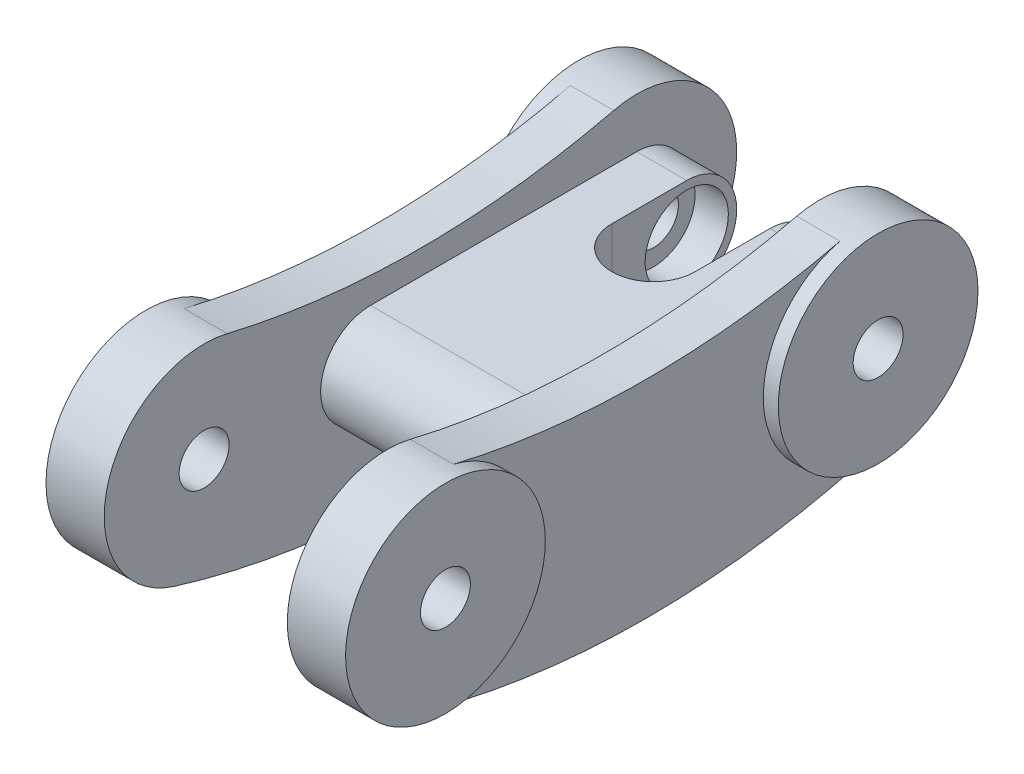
ISO-10303-21;
HEADER;
FILE_DESCRIPTION(('STEP AP214'),'2;1');
FILE_NAME('part.step','',(''),(''),'','','');
FILE_SCHEMA(('AUTOMOTIVE_DESIGN { 1 0 10303 214 1 1 1 1 }'));
ENDSEC;
DATA;
#1=APPLICATION_CONTEXT('core data for automotive mechanical design processes');
#2=APPLICATION_PROTOCOL_DEFINITION('international standard','automotive_design',2000,#1);
#3=PRODUCT_CONTEXT('',#1,'mechanical');
#4=PRODUCT('Part','Part','',(#3));
#5=PRODUCT_RELATED_PRODUCT_CATEGORY('part','',(#4));
#6=PRODUCT_DEFINITION_FORMATION('','',#4);
#7=PRODUCT_DEFINITION_CONTEXT('part definition',#1,'design');
#8=PRODUCT_DEFINITION('design','',#6,#7);
#9=PRODUCT_DEFINITION_SHAPE('','',#8);
#10=(LENGTH_UNIT() NAMED_UNIT(*) SI_UNIT(.MILLI.,.METRE.));
#11=(NAMED_UNIT(*) PLANE_ANGLE_UNIT() SI_UNIT($,.RADIAN.));
#12=(NAMED_UNIT(*) SI_UNIT($,.STERADIAN.) SOLID_ANGLE_UNIT());
#13=UNCERTAINTY_MEASURE_WITH_UNIT(LENGTH_MEASURE(1.E-05),#10,'distance_accuracy_value','');
#14=(GEOMETRIC_REPRESENTATION_CONTEXT(3) GLOBAL_UNCERTAINTY_ASSIGNED_CONTEXT((#13)) GLOBAL_UNIT_ASSIGNED_CONTEXT((#10,
#11,#12)) REPRESENTATION_CONTEXT('',''));
#15=CARTESIAN_POINT('',(0.,0.,0.));
#16=DIRECTION('',(0.,0.,1.));
#17=DIRECTION('',(1.,0.,0.));
#18=AXIS2_PLACEMENT_3D('',#15,#16,#17);
#19=CARTESIAN_POINT('',(0.,61.281230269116,-148.780880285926));
#20=DIRECTION('',(1.,0.,0.));
#21=DIRECTION('',(0.,0.,-1.));
#22=AXIS2_PLACEMENT_3D('',#19,#20,#21);
#23=PLANE('',#22);
#24=CARTESIAN_POINT('',(0.,0.,16.51));
#25=DIRECTION('',(-1.,0.,0.));
#26=DIRECTION('',(0.,0.,1.));
#27=AXIS2_PLACEMENT_3D('',#24,#25,#26);
#28=CIRCLE('',#27,7.62);
#29=CARTESIAN_POINT('',(0.,7.41183457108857,14.7410714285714));
#30=VERTEX_POINT('',#29);
#31=CARTESIAN_POINT('',(0.,-7.27981880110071,18.7613636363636));
#32=VERTEX_POINT('',#31);
#33=EDGE_CURVE('E158',#30,#32,#28,.T.);
#34=ORIENTED_EDGE('',*,*,#33,.F.);
#35=CARTESIAN_POINT('',(0.,69.1771226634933,0.));
#36=DIRECTION('',(1.,0.,0.));
#37=DIRECTION('',(0.,0.,-1.));
#38=AXIS2_PLACEMENT_3D('',#35,#36,#37);
#39=CIRCLE('',#38,63.5);
#40=CARTESIAN_POINT('',(0.,7.41183457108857,-14.7410714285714));
#41=VERTEX_POINT('',#40);
#42=EDGE_CURVE('E159',#30,#41,#39,.T.);
#43=ORIENTED_EDGE('',*,*,#42,.T.);
#44=CARTESIAN_POINT('',(0.,0.,-16.51));
#45=DIRECTION('',(-1.,0.,0.));
#46=DIRECTION('',(0.,0.,1.));
#47=AXIS2_PLACEMENT_3D('',#44,#45,#46);
#48=CIRCLE('',#47,7.62);
#49=CARTESIAN_POINT('',(0.,-7.27981880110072,-18.7613636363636));
#50=VERTEX_POINT('',#49);
#51=EDGE_CURVE('E11',#50,#41,#48,.T.);
#52=ORIENTED_EDGE('',*,*,#51,.F.);
#53=CARTESIAN_POINT('',(0.,53.3853378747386,0.));
#54=DIRECTION('',(1.,0.,0.));
#55=DIRECTION('',(0.,0.,-1.));
#56=AXIS2_PLACEMENT_3D('',#53,#54,#55);
#57=CIRCLE('',#56,63.5);
#58=EDGE_CURVE('E161',#32,#50,#57,.T.);
#59=ORIENTED_EDGE('',*,*,#58,.F.);
#60=EDGE_LOOP('',(#34,#43,#52,#59));
#61=FACE_BOUND('',#60,.T.);
#62=ADVANCED_FACE('F34',(#61),#23,.F.);
#63=CARTESIAN_POINT('',(20.574,26.6926689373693,8.25499999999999));
#64=DIRECTION('',(1.,0.,0.));
#65=DIRECTION('',(0.,0.,-1.));
#66=AXIS2_PLACEMENT_3D('',#63,#64,#65);
#67=PLANE('',#66);
#68=CARTESIAN_POINT('',(20.574,69.1771226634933,0.));
#69=DIRECTION('',(-1.,0.,0.));
#70=DIRECTION('',(0.,0.,-1.));
#71=AXIS2_PLACEMENT_3D('',#68,#69,#70);
#72=CIRCLE('',#71,63.5);
#73=CARTESIAN_POINT('',(20.574,7.41183457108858,-14.7410714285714));
#74=VERTEX_POINT('',#73);
#75=CARTESIAN_POINT('',(20.574,7.41183457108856,14.7410714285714));
#76=VERTEX_POINT('',#75);
#77=EDGE_CURVE('E200',#74,#76,#72,.T.);
#78=ORIENTED_EDGE('',*,*,#77,.T.);
#79=CARTESIAN_POINT('',(20.574,0.,16.51));
#80=DIRECTION('',(1.,0.,0.));
#81=DIRECTION('',(0.,0.,-1.));
#82=AXIS2_PLACEMENT_3D('',#79,#80,#81);
#83=CIRCLE('',#82,7.61999999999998);
#84=CARTESIAN_POINT('',(20.574,-7.2798188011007,18.7613636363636));
#85=VERTEX_POINT('',#84);
#86=EDGE_CURVE('E631',#85,#76,#83,.T.);
#87=ORIENTED_EDGE('',*,*,#86,.F.);
#88=CARTESIAN_POINT('',(20.574,53.3853378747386,0.));
#89=DIRECTION('',(1.,0.,0.));
#90=DIRECTION('',(0.,0.,-1.));
#91=AXIS2_PLACEMENT_3D('',#88,#89,#90);
#92=CIRCLE('',#91,63.5);
#93=CARTESIAN_POINT('',(20.574,-7.27981880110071,-18.7613636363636));
#94=VERTEX_POINT('',#93);
#95=EDGE_CURVE('E264',#85,#94,#92,.T.);
#96=ORIENTED_EDGE('',*,*,#95,.T.);
#97=CARTESIAN_POINT('',(20.574,0.,-16.51));
#98=DIRECTION('',(1.,0.,0.));
#99=DIRECTION('',(0.,0.,-1.));
#100=AXIS2_PLACEMENT_3D('',#97,#98,#99);
#101=CIRCLE('',#100,7.62);
#102=EDGE_CURVE('E203',#74,#94,#101,.T.);
#103=ORIENTED_EDGE('',*,*,#102,.F.);
#104=EDGE_LOOP('',(#78,#87,#96,#103));
#105=FACE_BOUND('',#104,.T.);
#106=ADVANCED_FACE('F345',(#105),#67,.T.);
#107=CARTESIAN_POINT('',(0.,0.,-16.51));
#108=DIRECTION('',(1.,0.,0.));
#109=DIRECTION('',(0.,0.,-1.));
#110=AXIS2_PLACEMENT_3D('',#107,#108,#109);
#111=CYLINDRICAL_SURFACE('',#110,1.905);
#112=CARTESIAN_POINT('',(16.002,0.,-16.51));
#113=DIRECTION('',(-1.,0.,0.));
#114=DIRECTION('',(0.,0.,1.));
#115=AXIS2_PLACEMENT_3D('',#112,#113,#114);
#116=CIRCLE('',#115,1.905);
#117=CARTESIAN_POINT('',(16.002,0.,-18.415));
#118=VERTEX_POINT('',#117);
#119=EDGE_CURVE('E220',#118,#118,#116,.F.);
#120=CARTESIAN_POINT('',(21.717,0.,-16.51));
#121=DIRECTION('',(1.,0.,0.));
#122=DIRECTION('',(0.,0.,-1.));
#123=AXIS2_PLACEMENT_3D('',#120,#121,#122);
#124=CIRCLE('',#123,1.905);
#125=CARTESIAN_POINT('',(21.717,0.,-18.415));
#126=VERTEX_POINT('',#125);
#127=EDGE_CURVE('E208',#126,#126,#124,.T.);
#128=CARTESIAN_POINT('',(16.002,0.,-18.415));
#129=CARTESIAN_POINT('',(16.06153125,0.,-18.415));
#130=CARTESIAN_POINT('',(16.1210625,0.,-18.415));
#131=CARTESIAN_POINT('',(16.240125,0.,-18.415));
#132=CARTESIAN_POINT('',(16.29965625,0.,-18.415));
#133=CARTESIAN_POINT('',(16.41871875,0.,-18.415));
#134=CARTESIAN_POINT('',(16.47825,0.,-18.415));
#135=CARTESIAN_POINT('',(16.5973125,0.,-18.415));
#136=CARTESIAN_POINT('',(16.65684375,0.,-18.415));
#137=CARTESIAN_POINT('',(16.77590625,0.,-18.415));
#138=CARTESIAN_POINT('',(16.8354375,0.,-18.415));
#139=CARTESIAN_POINT('',(16.9545,0.,-18.415));
#140=CARTESIAN_POINT('',(17.01403125,0.,-18.415));
#141=CARTESIAN_POINT('',(17.13309375,0.,-18.415));
#142=CARTESIAN_POINT('',(17.192625,0.,-18.415));
#143=CARTESIAN_POINT('',(17.3116875,0.,-18.415));
#144=CARTESIAN_POINT('',(17.37121875,0.,-18.415));
#145=CARTESIAN_POINT('',(17.49028125,0.,-18.415));
#146=CARTESIAN_POINT('',(17.5498125,0.,-18.415));
#147=CARTESIAN_POINT('',(17.668875,0.,-18.415));
#148=CARTESIAN_POINT('',(17.72840625,0.,-18.415));
#149=CARTESIAN_POINT('',(17.84746875,0.,-18.415));
#150=CARTESIAN_POINT('',(17.907,0.,-18.415));
#151=CARTESIAN_POINT('',(18.0260625,0.,-18.415));
#152=CARTESIAN_POINT('',(18.08559375,0.,-18.415));
#153=CARTESIAN_POINT('',(18.20465625,0.,-18.415));
#154=CARTESIAN_POINT('',(18.2641875,0.,-18.415));
#155=CARTESIAN_POINT('',(18.38325,0.,-18.415));
#156=CARTESIAN_POINT('',(18.44278125,0.,-18.415));
#157=CARTESIAN_POINT('',(18.56184375,0.,-18.415));
#158=CARTESIAN_POINT('',(18.621375,0.,-18.415));
#159=CARTESIAN_POINT('',(18.7404375,0.,-18.415));
#160=CARTESIAN_POINT('',(18.79996875,0.,-18.415));
#161=CARTESIAN_POINT('',(18.91903125,0.,-18.415));
#162=CARTESIAN_POINT('',(18.9785625,0.,-18.415));
#163=CARTESIAN_POINT('',(19.097625,0.,-18.415));
#164=CARTESIAN_POINT('',(19.15715625,0.,-18.415));
#165=CARTESIAN_POINT('',(19.27621875,0.,-18.415));
#166=CARTESIAN_POINT('',(19.33575,0.,-18.415));
#167=CARTESIAN_POINT('',(19.4548125,0.,-18.415));
#168=CARTESIAN_POINT('',(19.51434375,0.,-18.415));
#169=CARTESIAN_POINT('',(19.63340625,0.,-18.415));
#170=CARTESIAN_POINT('',(19.6929375,0.,-18.415));
#171=CARTESIAN_POINT('',(19.812,0.,-18.415));
#172=CARTESIAN_POINT('',(19.87153125,0.,-18.415));
#173=CARTESIAN_POINT('',(19.99059375,0.,-18.415));
#174=CARTESIAN_POINT('',(20.050125,0.,-18.415));
#175=CARTESIAN_POINT('',(20.1691875,0.,-18.415));
#176=CARTESIAN_POINT('',(20.22871875,0.,-18.415));
#177=CARTESIAN_POINT('',(20.34778125,0.,-18.415));
#178=CARTESIAN_POINT('',(20.4073125,0.,-18.415));
#179=CARTESIAN_POINT('',(20.526375,0.,-18.415));
#180=CARTESIAN_POINT('',(20.58590625,0.,-18.415));
#181=CARTESIAN_POINT('',(20.70496875,0.,-18.415));
#182=CARTESIAN_POINT('',(20.7645,0.,-18.415));
#183=CARTESIAN_POINT('',(20.8835625,0.,-18.415));
#184=CARTESIAN_POINT('',(20.94309375,0.,-18.415));
#185=CARTESIAN_POINT('',(21.06215625,0.,-18.415));
#186=CARTESIAN_POINT('',(21.1216875,0.,-18.415));
#187=CARTESIAN_POINT('',(21.24075,0.,-18.415));
#188=CARTESIAN_POINT('',(21.30028125,0.,-18.415));
#189=CARTESIAN_POINT('',(21.41934375,0.,-18.415));
#190=CARTESIAN_POINT('',(21.478875,0.,-18.415));
#191=CARTESIAN_POINT('',(21.5979375,0.,-18.415));
#192=CARTESIAN_POINT('',(21.65746875,0.,-18.415));
#193=CARTESIAN_POINT('',(21.717,0.,-18.415));
#194=B_SPLINE_CURVE_WITH_KNOTS('',3,(#128,#129,#130,#131,#132,#133,#134,#135,#136,#137,#138,
#139,#140,#141,#142,#143,#144,#145,#146,#147,#148,#149,#150,#151,#152,#153,#154,#155,#156,#157,
#158,#159,#160,#161,#162,#163,#164,#165,#166,#167,#168,#169,#170,#171,#172,#173,#174,#175,#176,
#177,#178,#179,#180,#181,#182,#183,#184,#185,#186,#187,#188,#189,#190,#191,#192,#193),
.UNSPECIFIED.,.F.,.F.,(4,2,2,2,2,2,2,2,2,2,2,2,2,2,2,2,2,2,2,2,2,2,2,2,2,2,2,2,2,2,2,2,4),(0.,
0.178593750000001,0.357187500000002,0.535781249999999,0.714375,0.892968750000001,1.0715625,
1.25015625,1.42875,1.60734375,1.7859375,1.96453125,2.143125,2.32171875,2.5003125,2.67890625,
2.8575,3.03609375,3.2146875,3.39328125,3.571875,3.75046875,3.9290625,4.10765625,4.28625,
4.46484375,4.6434375,4.82203125,5.000625,5.17921875,5.3578125,5.53640625,5.715),.UNSPECIFIED.);
#195=EDGE_CURVE('BSEAM350',#118,#126,#194,.T.);
#196=ORIENTED_EDGE('',*,*,#119,.F.);
#197=ORIENTED_EDGE('',*,*,#127,.T.);
#198=ORIENTED_EDGE('',*,*,#195,.T.);
#199=ORIENTED_EDGE('',*,*,#195,.F.);
#200=EDGE_LOOP('',(#196,#198,#197,#199));
#201=FACE_BOUND('',#200,.T.);
#202=ADVANCED_FACE('F350',(#201),#111,.F.);
#203=CARTESIAN_POINT('',(4.572,0.,-16.51));
#204=DIRECTION('',(1.,0.,0.));
#205=DIRECTION('',(0.,0.,-1.));
#206=AXIS2_PLACEMENT_3D('',#203,#204,#205);
#207=CIRCLE('',#206,1.905);
#208=CARTESIAN_POINT('',(4.572,0.,-18.415));
#209=VERTEX_POINT('',#208);
#210=EDGE_CURVE('E226',#209,#209,#207,.F.);
#211=CARTESIAN_POINT('',(-1.143,0.,-16.51));
#212=DIRECTION('',(-1.,0.,0.));
#213=DIRECTION('',(0.,0.,1.));
#214=AXIS2_PLACEMENT_3D('',#211,#212,#213);
#215=CIRCLE('',#214,1.905);
#216=CARTESIAN_POINT('',(-1.143,0.,-18.415));
#217=VERTEX_POINT('',#216);
#218=EDGE_CURVE('E210',#217,#217,#215,.T.);
#219=CARTESIAN_POINT('',(4.572,0.,-18.415));
#220=CARTESIAN_POINT('',(4.51246875,0.,-18.415));
#221=CARTESIAN_POINT('',(4.45293749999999,0.,-18.415));
#222=CARTESIAN_POINT('',(4.333875,0.,-18.415));
#223=CARTESIAN_POINT('',(4.27434375,0.,-18.415));
#224=CARTESIAN_POINT('',(4.15528125,0.,-18.415));
#225=CARTESIAN_POINT('',(4.09575,0.,-18.415));
#226=CARTESIAN_POINT('',(3.9766875,0.,-18.415));
#227=CARTESIAN_POINT('',(3.91715625,0.,-18.415));
#228=CARTESIAN_POINT('',(3.79809375,0.,-18.415));
#229=CARTESIAN_POINT('',(3.7385625,0.,-18.415));
#230=CARTESIAN_POINT('',(3.6195,0.,-18.415));
#231=CARTESIAN_POINT('',(3.55996875,0.,-18.415));
#232=CARTESIAN_POINT('',(3.44090625,0.,-18.415));
#233=CARTESIAN_POINT('',(3.381375,0.,-18.415));
#234=CARTESIAN_POINT('',(3.2623125,0.,-18.415));
#235=CARTESIAN_POINT('',(3.20278125,0.,-18.415));
#236=CARTESIAN_POINT('',(3.08371875,0.,-18.415));
#237=CARTESIAN_POINT('',(3.0241875,0.,-18.415));
#238=CARTESIAN_POINT('',(2.905125,0.,-18.415));
#239=CARTESIAN_POINT('',(2.84559375,0.,-18.415));
#240=CARTESIAN_POINT('',(2.72653125,0.,-18.415));
#241=CARTESIAN_POINT('',(2.667,0.,-18.415));
#242=CARTESIAN_POINT('',(2.5479375,0.,-18.415));
#243=CARTESIAN_POINT('',(2.48840625,0.,-18.415));
#244=CARTESIAN_POINT('',(2.36934375,0.,-18.415));
#245=CARTESIAN_POINT('',(2.3098125,0.,-18.415));
#246=CARTESIAN_POINT('',(2.19075,0.,-18.415));
#247=CARTESIAN_POINT('',(2.13121875,0.,-18.415));
#248=CARTESIAN_POINT('',(2.01215625,0.,-18.415));
#249=CARTESIAN_POINT('',(1.952625,0.,-18.415));
#250=CARTESIAN_POINT('',(1.8335625,0.,-18.415));
#251=CARTESIAN_POINT('',(1.77403125,0.,-18.415));
#252=CARTESIAN_POINT('',(1.65496875,0.,-18.415));
#253=CARTESIAN_POINT('',(1.5954375,0.,-18.415));
#254=CARTESIAN_POINT('',(1.476375,0.,-18.415));
#255=CARTESIAN_POINT('',(1.41684375,0.,-18.415));
#256=CARTESIAN_POINT('',(1.29778125,0.,-18.415));
#257=CARTESIAN_POINT('',(1.23825,0.,-18.415));
#258=CARTESIAN_POINT('',(1.1191875,0.,-18.415));
#259=CARTESIAN_POINT('',(1.05965625,0.,-18.415));
#260=CARTESIAN_POINT('',(0.940593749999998,0.,-18.415));
#261=CARTESIAN_POINT('',(0.881062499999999,0.,-18.415));
#262=CARTESIAN_POINT('',(0.761999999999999,0.,-18.415));
#263=CARTESIAN_POINT('',(0.702468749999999,0.,-18.415));
#264=CARTESIAN_POINT('',(0.583406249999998,0.,-18.415));
#265=CARTESIAN_POINT('',(0.523874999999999,0.,-18.415));
#266=CARTESIAN_POINT('',(0.404812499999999,0.,-18.415));
#267=CARTESIAN_POINT('',(0.345281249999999,0.,-18.415));
#268=CARTESIAN_POINT('',(0.22621875,0.,-18.415));
#269=CARTESIAN_POINT('',(0.1666875,0.,-18.415));
#270=CARTESIAN_POINT('',(0.0476249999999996,0.,-18.415));
#271=CARTESIAN_POINT('',(-0.0119062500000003,0.,-18.415));
#272=CARTESIAN_POINT('',(-0.13096875,0.,-18.415));
#273=CARTESIAN_POINT('',(-0.1905,0.,-18.415));
#274=CARTESIAN_POINT('',(-0.3095625,0.,-18.415));
#275=CARTESIAN_POINT('',(-0.36909375,0.,-18.415));
#276=CARTESIAN_POINT('',(-0.48815625,0.,-18.415));
#277=CARTESIAN_POINT('',(-0.5476875,0.,-18.415));
#278=CARTESIAN_POINT('',(-0.66675,0.,-18.415));
#279=CARTESIAN_POINT('',(-0.72628125,0.,-18.415));
#280=CARTESIAN_POINT('',(-0.84534375,0.,-18.415));
#281=CARTESIAN_POINT('',(-0.904875,0.,-18.415));
#282=CARTESIAN_POINT('',(-1.0239375,0.,-18.415));
#283=CARTESIAN_POINT('',(-1.08346875,0.,-18.415));
#284=CARTESIAN_POINT('',(-1.143,0.,-18.415));
#285=B_SPLINE_CURVE_WITH_KNOTS('',3,(#219,#220,#221,#222,#223,#224,#225,#226,#227,#228,#229,
#230,#231,#232,#233,#234,#235,#236,#237,#238,#239,#240,#241,#242,#243,#244,#245,#246,#247,#248,
#249,#250,#251,#252,#253,#254,#255,#256,#257,#258,#259,#260,#261,#262,#263,#264,#265,#266,#267,
#268,#269,#270,#271,#272,#273,#274,#275,#276,#277,#278,#279,#280,#281,#282,#283,#284),
.UNSPECIFIED.,.F.,.F.,(4,2,2,2,2,2,2,2,2,2,2,2,2,2,2,2,2,2,2,2,2,2,2,2,2,2,2,2,2,2,2,2,4),(0.,
0.17859375,0.3571875,0.53578125,0.714374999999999,0.892968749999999,1.0715625,1.25015625,
1.42875,1.60734375,1.7859375,1.96453125,2.143125,2.32171875,2.5003125,2.67890625,2.8575,
3.03609375,3.2146875,3.39328125,3.571875,3.75046875,3.9290625,4.10765625,4.28625,4.46484375,
4.6434375,4.82203125,5.000625,5.17921875,5.3578125,5.53640625,5.715),.UNSPECIFIED.);
#286=EDGE_CURVE('BSEAM414',#209,#217,#285,.T.);
#287=ORIENTED_EDGE('',*,*,#210,.F.);
#288=ORIENTED_EDGE('',*,*,#218,.T.);
#289=ORIENTED_EDGE('',*,*,#286,.T.);
#290=ORIENTED_EDGE('',*,*,#286,.F.);
#291=EDGE_LOOP('',(#287,#289,#288,#290));
#292=FACE_BOUND('',#291,.T.);
#293=ADVANCED_FACE('F414',(#292),#111,.F.);
#294=CARTESIAN_POINT('',(10.287,-8.89,-10.795));
#295=DIRECTION('',(0.,1.,0.));
#296=DIRECTION('',(0.,0.,1.));
#297=AXIS2_PLACEMENT_3D('',#294,#295,#296);
#298=CYLINDRICAL_SURFACE('',#297,3.175);
#299=CARTESIAN_POINT('',(10.287,-3.81,-10.795));
#300=DIRECTION('',(0.,-1.,0.));
#301=DIRECTION('',(0.,0.,-1.));
#302=AXIS2_PLACEMENT_3D('',#299,#300,#301);
#303=CIRCLE('',#302,3.175);
#304=CARTESIAN_POINT('',(13.462,-3.81,-10.795));
#305=VERTEX_POINT('',#304);
#306=CARTESIAN_POINT('',(7.112,-3.81,-10.795));
#307=VERTEX_POINT('',#306);
#308=EDGE_CURVE('E43',#305,#307,#303,.T.);
#309=ORIENTED_EDGE('',*,*,#308,.T.);
#310=DIRECTION('',(0.,1.,0.));
#311=VECTOR('',#310,1.);
#312=CARTESIAN_POINT('',(7.112,-8.89,-10.795));
#313=LINE('',#312,#311);
#314=CARTESIAN_POINT('',(7.112,3.81,-10.795));
#315=VERTEX_POINT('',#314);
#316=EDGE_CURVE('E243',#307,#315,#313,.T.);
#317=ORIENTED_EDGE('',*,*,#316,.T.);
#318=CARTESIAN_POINT('',(10.287,3.81,-10.795));
#319=DIRECTION('',(0.,1.,0.));
#320=DIRECTION('',(0.,0.,1.));
#321=AXIS2_PLACEMENT_3D('',#318,#319,#320);
#322=CIRCLE('',#321,3.175);
#323=CARTESIAN_POINT('',(13.462,3.81,-10.795));
#324=VERTEX_POINT('',#323);
#325=EDGE_CURVE('E237',#315,#324,#322,.T.);
#326=ORIENTED_EDGE('',*,*,#325,.T.);
#327=DIRECTION('',(0.,1.,0.));
#328=VECTOR('',#327,1.);
#329=CARTESIAN_POINT('',(13.462,-8.89,-10.795));
#330=LINE('',#329,#328);
#331=EDGE_CURVE('E244',#305,#324,#330,.T.);
#332=ORIENTED_EDGE('',*,*,#331,.F.);
#333=EDGE_LOOP('',(#309,#317,#326,#332));
#334=FACE_BOUND('',#333,.T.);
#335=CARTESIAN_POINT('',(9.2075,0.,-7.80914924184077));
#336=CARTESIAN_POINT('',(9.20750061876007,0.0517379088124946,-7.80914869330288));
#337=CARTESIAN_POINT('',(9.21173077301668,0.103481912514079,-7.8076093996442));
#338=CARTESIAN_POINT('',(9.22848457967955,0.205443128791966,-7.80163286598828));
#339=CARTESIAN_POINT('',(9.24101120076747,0.255659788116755,-7.79719458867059));
#340=CARTESIAN_POINT('',(9.27386166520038,0.353061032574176,-7.78593472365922));
#341=CARTESIAN_POINT('',(9.29416953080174,0.400251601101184,-7.77911802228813));
#342=CARTESIAN_POINT('',(9.34194063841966,0.490557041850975,-7.76380971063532));
#343=CARTESIAN_POINT('',(9.36940514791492,0.533671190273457,-7.75531780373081));
#344=CARTESIAN_POINT('',(9.43186413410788,0.616322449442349,-7.73714769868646));
#345=CARTESIAN_POINT('',(9.46709478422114,0.655674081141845,-7.72743772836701));
#346=CARTESIAN_POINT('',(9.54356517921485,0.728036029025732,-7.70801371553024));
#347=CARTESIAN_POINT('',(9.58480610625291,0.761045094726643,-7.69829967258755));
#348=CARTESIAN_POINT('',(9.67376611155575,0.820852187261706,-7.67944214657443));
#349=CARTESIAN_POINT('',(9.72165414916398,0.847409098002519,-7.67032810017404));
#350=CARTESIAN_POINT('',(9.82153130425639,0.892011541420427,-7.6538980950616));
#351=CARTESIAN_POINT('',(9.87351967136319,0.910058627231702,-7.64658180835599));
#352=CARTESIAN_POINT('',(9.97872918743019,0.936623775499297,-7.6345690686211));
#353=CARTESIAN_POINT('',(10.0318839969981,0.945375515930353,-7.62980993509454));
#354=CARTESIAN_POINT('',(10.1390748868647,0.953785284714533,-7.6229936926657));
#355=CARTESIAN_POINT('',(10.1931107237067,0.953445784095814,-7.62093584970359));
#356=CARTESIAN_POINT('',(10.2982250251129,0.94383479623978,-7.61960189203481));
#357=CARTESIAN_POINT('',(10.3493352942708,0.934921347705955,-7.62021773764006));
#358=CARTESIAN_POINT('',(10.4493567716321,0.908954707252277,-7.62375882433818));
#359=CARTESIAN_POINT('',(10.4982679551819,0.891901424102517,-7.6266840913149));
#360=CARTESIAN_POINT('',(10.5926038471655,0.850161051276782,-7.63438680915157));
#361=CARTESIAN_POINT('',(10.6380252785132,0.825466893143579,-7.63916597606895));
#362=CARTESIAN_POINT('',(10.7241900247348,0.76915289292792,-7.64994387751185));
#363=CARTESIAN_POINT('',(10.7649324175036,0.737531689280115,-7.65594285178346));
#364=CARTESIAN_POINT('',(10.8420357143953,0.667011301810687,-7.66863787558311));
#365=CARTESIAN_POINT('',(10.8782022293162,0.627902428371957,-7.67535062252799));
#366=CARTESIAN_POINT('',(10.9435507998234,0.54417386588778,-7.68844568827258));
#367=CARTESIAN_POINT('',(10.9727320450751,0.499553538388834,-7.69482796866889));
#368=CARTESIAN_POINT('',(11.0236789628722,0.405251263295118,-7.7065334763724));
#369=CARTESIAN_POINT('',(11.0453277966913,0.355503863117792,-7.71183952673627));
#370=CARTESIAN_POINT('',(11.0799030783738,0.252909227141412,-7.72054869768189));
#371=CARTESIAN_POINT('',(11.0928315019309,0.2000626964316,-7.7239522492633));
#372=CARTESIAN_POINT('',(11.1093001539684,0.0942286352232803,-7.72832119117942));
#373=CARTESIAN_POINT('',(11.1130742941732,0.0412800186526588,-7.72934729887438));
#374=CARTESIAN_POINT('',(11.1117842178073,-0.0644974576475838,-7.72899989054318));
#375=CARTESIAN_POINT('',(11.1067210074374,-0.117326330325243,-7.72762664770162));
#376=CARTESIAN_POINT('',(11.0881349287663,-0.220225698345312,-7.72272139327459));
#377=CARTESIAN_POINT('',(11.0747896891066,-0.270330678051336,-7.71923474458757));
#378=CARTESIAN_POINT('',(11.0402254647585,-0.367592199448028,-7.71058893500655));
#379=CARTESIAN_POINT('',(11.0190054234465,-0.414748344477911,-7.70542954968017));
#380=CARTESIAN_POINT('',(10.9687850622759,-0.505849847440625,-7.69395685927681));
#381=CARTESIAN_POINT('',(10.939633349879,-0.549708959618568,-7.68762195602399));
#382=CARTESIAN_POINT('',(10.8745386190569,-0.632016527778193,-7.6746598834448));
#383=CARTESIAN_POINT('',(10.838594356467,-0.67046399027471,-7.66803266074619));
#384=CARTESIAN_POINT('',(10.759775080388,-0.741909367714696,-7.65513654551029));
#385=CARTESIAN_POINT('',(10.7167406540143,-0.774734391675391,-7.64888194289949));
#386=CARTESIAN_POINT('',(10.6256065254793,-0.832695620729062,-7.6377742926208));
#387=CARTESIAN_POINT('',(10.5775073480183,-0.857832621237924,-7.63292109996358));
#388=CARTESIAN_POINT('',(10.4782584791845,-0.899345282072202,-7.62538069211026));
#389=CARTESIAN_POINT('',(10.4271580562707,-0.915833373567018,-7.62266543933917));
#390=CARTESIAN_POINT('',(10.3228496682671,-0.940000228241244,-7.61977429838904));
#391=CARTESIAN_POINT('',(10.2696422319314,-0.947681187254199,-7.61959777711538));
#392=CARTESIAN_POINT('',(10.1645689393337,-0.953892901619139,-7.62194081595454));
#393=CARTESIAN_POINT('',(10.1127185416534,-0.952724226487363,-7.62436942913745));
#394=CARTESIAN_POINT('',(10.0100665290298,-0.942039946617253,-7.63168195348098));
#395=CARTESIAN_POINT('',(9.95926491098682,-0.932524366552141,-7.63656585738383));
#396=CARTESIAN_POINT('',(9.8601253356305,-0.905522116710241,-7.64843104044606));
#397=CARTESIAN_POINT('',(9.81178601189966,-0.88803992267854,-7.65541114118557));
#398=CARTESIAN_POINT('',(9.71873769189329,-0.845670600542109,-7.67091124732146));
#399=CARTESIAN_POINT('',(9.67402944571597,-0.820781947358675,-7.67943156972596));
#400=CARTESIAN_POINT('',(9.58760010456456,-0.763162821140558,-7.69766356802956));
#401=CARTESIAN_POINT('',(9.54606663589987,-0.730161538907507,-7.70740899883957));
#402=CARTESIAN_POINT('',(9.46902812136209,-0.65773157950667,-7.72691764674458));
#403=CARTESIAN_POINT('',(9.43352499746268,-0.61830086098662,-7.73668086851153));
#404=CARTESIAN_POINT('',(9.36853375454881,-0.532734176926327,-7.7555551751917));
#405=CARTESIAN_POINT('',(9.3392484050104,-0.486437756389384,-7.76463936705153));
#406=CARTESIAN_POINT('',(9.28894701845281,-0.389246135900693,-7.78083049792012));
#407=CARTESIAN_POINT('',(9.26792603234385,-0.338353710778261,-7.78793861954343));
#408=CARTESIAN_POINT('',(9.23693892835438,-0.239880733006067,-7.79863029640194));
#409=CARTESIAN_POINT('',(9.22593194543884,-0.192661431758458,-7.80253957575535));
#410=CARTESIAN_POINT('',(9.21121312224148,-0.096962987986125,-7.80779897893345));
#411=CARTESIAN_POINT('',(9.20749942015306,-0.0484841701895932,-7.80914975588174));
#412=CARTESIAN_POINT('',(9.2075,0.,-7.80914924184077));
#413=B_SPLINE_CURVE_WITH_KNOTS('',3,(#335,#336,#337,#338,#339,#340,#341,#342,#343,#344,#345,
#346,#347,#348,#349,#350,#351,#352,#353,#354,#355,#356,#357,#358,#359,#360,#361,#362,#363,#364,
#365,#366,#367,#368,#369,#370,#371,#372,#373,#374,#375,#376,#377,#378,#379,#380,#381,#382,#383,
#384,#385,#386,#387,#388,#389,#390,#391,#392,#393,#394,#395,#396,#397,#398,#399,#400,#401,#402,
#403,#404,#405,#406,#407,#408,#409,#410,#411,#412),.UNSPECIFIED.,.T.,.F.,(4,2,2,2,2,2,2,2,2,2,2,
2,2,2,2,2,2,2,2,2,2,2,2,2,2,2,2,2,2,2,2,2,2,2,2,2,2,2,4),(0.,0.155033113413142,
0.310121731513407,0.464893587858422,0.61969287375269,0.780084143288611,0.940507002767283,
1.1062277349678,1.27191820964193,1.43333691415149,1.59471174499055,1.74962769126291,
1.90454537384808,2.05960679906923,2.21469873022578,2.37502731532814,2.53537449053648,
2.69810828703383,2.8608052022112,3.01929890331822,3.17777455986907,3.33296347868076,
3.48817322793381,3.6465830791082,3.80502197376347,3.9676907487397,4.13034268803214,
4.29082428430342,4.45126585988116,4.6062832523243,4.76130018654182,4.9162301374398,
5.07119201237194,5.23227197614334,5.39340318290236,5.55917676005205,5.72485091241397,
5.8701712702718,6.01545452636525),.UNSPECIFIED.);
#414=CARTESIAN_POINT('',(9.2075,0.,-7.80914924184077));
#415=VERTEX_POINT('',#414);
#416=EDGE_CURVE('E233',#415,#415,#413,.T.);
#417=ORIENTED_EDGE('',*,*,#416,.F.);
#418=EDGE_LOOP('',(#417));
#419=FACE_BOUND('',#418,.T.);
#420=ADVANCED_FACE('F322',(#334,#419),#298,.F.);
#421=CARTESIAN_POINT('',(17.272,0.,-16.51));
#422=DIRECTION('',(-1.,0.,0.));
#423=DIRECTION('',(0.,0.,1.));
#424=AXIS2_PLACEMENT_3D('',#421,#422,#423);
#425=CYLINDRICAL_SURFACE('',#424,3.81);
#426=CARTESIAN_POINT('',(13.462,0.,-16.51));
#427=DIRECTION('',(-1.,0.,0.));
#428=DIRECTION('',(0.,0.,1.));
#429=AXIS2_PLACEMENT_3D('',#426,#427,#428);
#430=CIRCLE('',#429,3.81);
#431=CARTESIAN_POINT('',(13.462,3.81,-16.51));
#432=VERTEX_POINT('',#431);
#433=CARTESIAN_POINT('',(13.462,-3.81,-16.51));
#434=VERTEX_POINT('',#433);
#435=EDGE_CURVE('E171',#432,#434,#430,.T.);
#436=ORIENTED_EDGE('',*,*,#435,.F.);
#437=DIRECTION('',(-1.,0.,0.));
#438=VECTOR('',#437,1.);
#439=CARTESIAN_POINT('',(17.272,3.81,-16.51));
#440=LINE('',#439,#438);
#441=CARTESIAN_POINT('',(17.272,3.81,-16.51));
#442=VERTEX_POINT('',#441);
#443=EDGE_CURVE('E297',#442,#432,#440,.T.);
#444=ORIENTED_EDGE('',*,*,#443,.F.);
#445=CARTESIAN_POINT('',(17.272,0.,-16.51));
#446=DIRECTION('',(1.,0.,0.));
#447=DIRECTION('',(0.,0.,-1.));
#448=AXIS2_PLACEMENT_3D('',#445,#446,#447);
#449=CIRCLE('',#448,3.81);
#450=CARTESIAN_POINT('',(17.272,-3.81,-16.51));
#451=VERTEX_POINT('',#450);
#452=EDGE_CURVE('E284',#451,#442,#449,.T.);
#453=ORIENTED_EDGE('',*,*,#452,.F.);
#454=DIRECTION('',(-1.,0.,0.));
#455=VECTOR('',#454,1.);
#456=CARTESIAN_POINT('',(17.272,-3.81,-16.51));
#457=LINE('',#456,#455);
#458=EDGE_CURVE('E300',#451,#434,#457,.T.);
#459=ORIENTED_EDGE('',*,*,#458,.T.);
#460=EDGE_LOOP('',(#436,#444,#453,#459));
#461=FACE_BOUND('',#460,.T.);
#462=ADVANCED_FACE('F372',(#461),#425,.T.);
#463=CARTESIAN_POINT('',(3.302,61.281230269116,-148.780880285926));
#464=DIRECTION('',(1.,0.,0.));
#465=DIRECTION('',(0.,0.,-1.));
#466=AXIS2_PLACEMENT_3D('',#463,#464,#465);
#467=PLANE('',#466);
#468=CARTESIAN_POINT('',(3.302,69.1771226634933,0.));
#469=DIRECTION('',(1.,0.,0.));
#470=DIRECTION('',(0.,0.,-1.));
#471=AXIS2_PLACEMENT_3D('',#468,#469,#470);
#472=CIRCLE('',#471,63.5);
#473=CARTESIAN_POINT('',(3.302,7.41183457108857,14.7410714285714));
#474=VERTEX_POINT('',#473);
#475=CARTESIAN_POINT('',(3.302,7.41183457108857,-14.7410714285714));
#476=VERTEX_POINT('',#475);
#477=EDGE_CURVE('E177',#474,#476,#472,.T.);
#478=ORIENTED_EDGE('',*,*,#477,.F.);
#479=CARTESIAN_POINT('',(3.302,0.,16.51));
#480=DIRECTION('',(1.,0.,0.));
#481=DIRECTION('',(0.,0.,-1.));
#482=AXIS2_PLACEMENT_3D('',#479,#480,#481);
#483=CIRCLE('',#482,7.62);
#484=CARTESIAN_POINT('',(3.302,-7.27981880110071,18.7613636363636));
#485=VERTEX_POINT('',#484);
#486=EDGE_CURVE('E170',#474,#485,#483,.T.);
#487=ORIENTED_EDGE('',*,*,#486,.T.);
#488=CARTESIAN_POINT('',(3.302,53.3853378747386,0.));
#489=DIRECTION('',(1.,0.,0.));
#490=DIRECTION('',(0.,0.,-1.));
#491=AXIS2_PLACEMENT_3D('',#488,#489,#490);
#492=CIRCLE('',#491,63.5);
#493=CARTESIAN_POINT('',(3.302,-7.27981880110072,-18.7613636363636));
#494=VERTEX_POINT('',#493);
#495=EDGE_CURVE('E308',#485,#494,#492,.T.);
#496=ORIENTED_EDGE('',*,*,#495,.T.);
#497=CARTESIAN_POINT('',(3.302,0.,-16.51));
#498=DIRECTION('',(1.,0.,0.));
#499=DIRECTION('',(0.,0.,-1.));
#500=AXIS2_PLACEMENT_3D('',#497,#498,#499);
#501=CIRCLE('',#500,7.62);
#502=EDGE_CURVE('E60',#494,#476,#501,.T.);
#503=ORIENTED_EDGE('',*,*,#502,.T.);
#504=EDGE_LOOP('',(#478,#487,#496,#503));
#505=FACE_BOUND('',#504,.T.);
#506=CARTESIAN_POINT('',(3.302,0.,16.51));
#507=DIRECTION('',(1.,0.,0.));
#508=DIRECTION('',(0.,0.,-1.));
#509=AXIS2_PLACEMENT_3D('',#506,#507,#508);
#510=CIRCLE('',#509,1.905);
#511=CARTESIAN_POINT('',(3.302,0.,14.605));
#512=VERTEX_POINT('',#511);
#513=EDGE_CURVE('E175',#512,#512,#510,.T.);
#514=ORIENTED_EDGE('',*,*,#513,.F.);
#515=EDGE_LOOP('',(#514));
#516=FACE_BOUND('',#515,.T.);
#517=CARTESIAN_POINT('',(3.302,0.,3.81));
#518=DIRECTION('',(1.,0.,0.));
#519=DIRECTION('',(0.,0.,-1.));
#520=AXIS2_PLACEMENT_3D('',#517,#518,#519);
#521=CIRCLE('',#520,3.81);
#522=CARTESIAN_POINT('',(3.302,3.81,3.81));
#523=VERTEX_POINT('',#522);
#524=CARTESIAN_POINT('',(3.302,-3.81,3.81));
#525=VERTEX_POINT('',#524);
#526=EDGE_CURVE('E290',#523,#525,#521,.T.);
#527=ORIENTED_EDGE('',*,*,#526,.F.);
#528=DIRECTION('',(0.,0.,1.));
#529=VECTOR('',#528,1.);
#530=CARTESIAN_POINT('',(3.302,3.81000000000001,-40.1332359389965));
#531=LINE('',#530,#529);
#532=CARTESIAN_POINT('',(3.302,3.81,-16.51));
#533=VERTEX_POINT('',#532);
#534=EDGE_CURVE('E272',#533,#523,#531,.T.);
#535=ORIENTED_EDGE('',*,*,#534,.F.);
#536=CARTESIAN_POINT('',(3.302,0.,-16.51));
#537=DIRECTION('',(1.,0.,0.));
#538=DIRECTION('',(0.,0.,-1.));
#539=AXIS2_PLACEMENT_3D('',#536,#537,#538);
#540=CIRCLE('',#539,3.81);
#541=CARTESIAN_POINT('',(3.302,-3.81,-16.51));
#542=VERTEX_POINT('',#541);
#543=EDGE_CURVE('E278',#542,#533,#540,.T.);
#544=ORIENTED_EDGE('',*,*,#543,.F.);
#545=DIRECTION('',(0.,0.,1.));
#546=VECTOR('',#545,1.);
#547=CARTESIAN_POINT('',(3.302,-3.81,-40.1332359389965));
#548=LINE('',#547,#546);
#549=EDGE_CURVE('E293',#542,#525,#548,.T.);
#550=ORIENTED_EDGE('',*,*,#549,.T.);
#551=EDGE_LOOP('',(#527,#535,#544,#550));
#552=FACE_BOUND('',#551,.T.);
#553=ADVANCED_FACE('F355',(#505,#516,#552),#467,.T.);
#554=CARTESIAN_POINT('',(3.302,69.1771226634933,0.));
#555=DIRECTION('',(-1.,0.,0.));
#556=DIRECTION('',(0.,0.,1.));
#557=AXIS2_PLACEMENT_3D('',#554,#555,#556);
#558=CYLINDRICAL_SURFACE('',#557,63.5);
#559=ORIENTED_EDGE('',*,*,#42,.F.);
#560=DIRECTION('',(-1.,0.,0.));
#561=VECTOR('',#560,1.);
#562=CARTESIAN_POINT('',(3.302,7.41183457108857,14.7410714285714));
#563=LINE('',#562,#561);
#564=EDGE_CURVE('E82',#474,#30,#563,.T.);
#565=ORIENTED_EDGE('',*,*,#564,.F.);
#566=ORIENTED_EDGE('',*,*,#477,.T.);
#567=DIRECTION('',(-1.,0.,0.));
#568=VECTOR('',#567,1.);
#569=CARTESIAN_POINT('',(3.302,7.41183457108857,-14.7410714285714));
#570=LINE('',#569,#568);
#571=EDGE_CURVE('E174',#476,#41,#570,.T.);
#572=ORIENTED_EDGE('',*,*,#571,.T.);
#573=EDGE_LOOP('',(#559,#565,#566,#572));
#574=FACE_BOUND('',#573,.T.);
#575=ADVANCED_FACE('F36',(#574),#558,.F.);
#576=CARTESIAN_POINT('',(3.302,0.,16.51));
#577=DIRECTION('',(-1.,0.,0.));
#578=DIRECTION('',(0.,0.,1.));
#579=AXIS2_PLACEMENT_3D('',#576,#577,#578);
#580=CYLINDRICAL_SURFACE('',#579,7.62);
#581=ORIENTED_EDGE('',*,*,#564,.T.);
#582=ORIENTED_EDGE('',*,*,#33,.T.);
#583=DIRECTION('',(-1.,0.,0.));
#584=VECTOR('',#583,1.);
#585=CARTESIAN_POINT('',(3.302,-7.27981880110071,18.7613636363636));
#586=LINE('',#585,#584);
#587=EDGE_CURVE('E172',#485,#32,#586,.T.);
#588=ORIENTED_EDGE('',*,*,#587,.F.);
#589=ORIENTED_EDGE('',*,*,#486,.F.);
#590=EDGE_LOOP('',(#581,#582,#588,#589));
#591=FACE_BOUND('',#590,.T.);
#592=CARTESIAN_POINT('',(-1.143,0.,16.51));
#593=DIRECTION('',(-1.,0.,0.));
#594=DIRECTION('',(0.,0.,1.));
#595=AXIS2_PLACEMENT_3D('',#592,#593,#594);
#596=CIRCLE('',#595,7.62);
#597=CARTESIAN_POINT('',(-1.143,0.,24.13));
#598=VERTEX_POINT('',#597);
#599=EDGE_CURVE('E165',#598,#598,#596,.T.);
#600=ORIENTED_EDGE('',*,*,#599,.F.);
#601=EDGE_LOOP('',(#600));
#602=FACE_BOUND('',#601,.T.);
#603=ADVANCED_FACE('F168',(#591,#602),#580,.T.);
#604=CARTESIAN_POINT('',(3.302,53.3853378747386,0.));
#605=DIRECTION('',(-1.,0.,0.));
#606=DIRECTION('',(0.,0.,1.));
#607=AXIS2_PLACEMENT_3D('',#604,#605,#606);
#608=CYLINDRICAL_SURFACE('',#607,63.5);
#609=ORIENTED_EDGE('',*,*,#58,.T.);
#610=DIRECTION('',(-1.,0.,0.));
#611=VECTOR('',#610,1.);
#612=CARTESIAN_POINT('',(3.302,-7.27981880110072,-18.7613636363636));
#613=LINE('',#612,#611);
#614=EDGE_CURVE('E189',#494,#50,#613,.T.);
#615=ORIENTED_EDGE('',*,*,#614,.F.);
#616=ORIENTED_EDGE('',*,*,#495,.F.);
#617=ORIENTED_EDGE('',*,*,#587,.T.);
#618=EDGE_LOOP('',(#609,#615,#616,#617));
#619=FACE_BOUND('',#618,.T.);
#620=ADVANCED_FACE('F361',(#619),#608,.T.);
#621=CARTESIAN_POINT('',(3.302,0.,-16.51));
#622=DIRECTION('',(-1.,0.,0.));
#623=DIRECTION('',(0.,0.,1.));
#624=AXIS2_PLACEMENT_3D('',#621,#622,#623);
#625=CYLINDRICAL_SURFACE('',#624,7.62);
#626=ORIENTED_EDGE('',*,*,#614,.T.);
#627=ORIENTED_EDGE('',*,*,#51,.T.);
#628=ORIENTED_EDGE('',*,*,#571,.F.);
#629=ORIENTED_EDGE('',*,*,#502,.F.);
#630=EDGE_LOOP('',(#626,#627,#628,#629));
#631=FACE_BOUND('',#630,.T.);
#632=CARTESIAN_POINT('',(-1.143,0.,-16.51));
#633=DIRECTION('',(-1.,0.,0.));
#634=DIRECTION('',(0.,0.,1.));
#635=AXIS2_PLACEMENT_3D('',#632,#633,#634);
#636=CIRCLE('',#635,7.62);
#637=CARTESIAN_POINT('',(-1.143,0.,-8.89));
#638=VERTEX_POINT('',#637);
#639=EDGE_CURVE('E213',#638,#638,#636,.T.);
#640=ORIENTED_EDGE('',*,*,#639,.F.);
#641=EDGE_LOOP('',(#640));
#642=FACE_BOUND('',#641,.T.);
#643=ADVANCED_FACE('F357',(#631,#642),#625,.T.);
#644=CARTESIAN_POINT('',(0.,0.,16.51));
#645=DIRECTION('',(1.,0.,0.));
#646=DIRECTION('',(0.,0.,-1.));
#647=AXIS2_PLACEMENT_3D('',#644,#645,#646);
#648=CYLINDRICAL_SURFACE('',#647,1.905);
#649=CARTESIAN_POINT('',(-1.143,0.,16.51));
#650=DIRECTION('',(-1.,0.,0.));
#651=DIRECTION('',(0.,0.,1.));
#652=AXIS2_PLACEMENT_3D('',#649,#650,#651);
#653=CIRCLE('',#652,1.905);
#654=CARTESIAN_POINT('',(-1.143,0.,14.605));
#655=VERTEX_POINT('',#654);
#656=EDGE_CURVE('E166',#655,#655,#653,.T.);
#657=CARTESIAN_POINT('',(3.302,0.,14.605));
#658=CARTESIAN_POINT('',(3.25569791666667,0.,14.605));
#659=CARTESIAN_POINT('',(3.20939583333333,0.,14.605));
#660=CARTESIAN_POINT('',(3.11679166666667,0.,14.605));
#661=CARTESIAN_POINT('',(3.07048958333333,0.,14.605));
#662=CARTESIAN_POINT('',(2.97788541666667,0.,14.605));
#663=CARTESIAN_POINT('',(2.93158333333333,0.,14.605));
#664=CARTESIAN_POINT('',(2.83897916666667,0.,14.605));
#665=CARTESIAN_POINT('',(2.79267708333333,0.,14.605));
#666=CARTESIAN_POINT('',(2.70007291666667,0.,14.605));
#667=CARTESIAN_POINT('',(2.65377083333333,0.,14.605));
#668=CARTESIAN_POINT('',(2.56116666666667,0.,14.605));
#669=CARTESIAN_POINT('',(2.51486458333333,0.,14.605));
#670=CARTESIAN_POINT('',(2.42226041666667,0.,14.605));
#671=CARTESIAN_POINT('',(2.37595833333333,0.,14.605));
#672=CARTESIAN_POINT('',(2.28335416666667,0.,14.605));
#673=CARTESIAN_POINT('',(2.23705208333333,0.,14.605));
#674=CARTESIAN_POINT('',(2.14444791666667,0.,14.605));
#675=CARTESIAN_POINT('',(2.09814583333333,0.,14.605));
#676=CARTESIAN_POINT('',(2.00554166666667,0.,14.605));
#677=CARTESIAN_POINT('',(1.95923958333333,0.,14.605));
#678=CARTESIAN_POINT('',(1.86663541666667,0.,14.605));
#679=CARTESIAN_POINT('',(1.82033333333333,0.,14.605));
#680=CARTESIAN_POINT('',(1.72772916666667,0.,14.605));
#681=CARTESIAN_POINT('',(1.68142708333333,0.,14.605));
#682=CARTESIAN_POINT('',(1.58882291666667,0.,14.605));
#683=CARTESIAN_POINT('',(1.54252083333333,0.,14.605));
#684=CARTESIAN_POINT('',(1.44991666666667,0.,14.605));
#685=CARTESIAN_POINT('',(1.40361458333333,0.,14.605));
#686=CARTESIAN_POINT('',(1.31101041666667,0.,14.605));
#687=CARTESIAN_POINT('',(1.26470833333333,0.,14.605));
#688=CARTESIAN_POINT('',(1.17210416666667,0.,14.605));
#689=CARTESIAN_POINT('',(1.12580208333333,0.,14.605));
#690=CARTESIAN_POINT('',(1.03319791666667,0.,14.605));
#691=CARTESIAN_POINT('',(0.986895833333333,0.,14.605));
#692=CARTESIAN_POINT('',(0.894291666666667,0.,14.605));
#693=CARTESIAN_POINT('',(0.847989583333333,0.,14.605));
#694=CARTESIAN_POINT('',(0.755385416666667,0.,14.605));
#695=CARTESIAN_POINT('',(0.709083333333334,0.,14.605));
#696=CARTESIAN_POINT('',(0.616479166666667,0.,14.605));
#697=CARTESIAN_POINT('',(0.570177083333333,0.,14.605));
#698=CARTESIAN_POINT('',(0.477572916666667,0.,14.605));
#699=CARTESIAN_POINT('',(0.431270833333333,0.,14.605));
#700=CARTESIAN_POINT('',(0.338666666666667,0.,14.605));
#701=CARTESIAN_POINT('',(0.292364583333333,0.,14.605));
#702=CARTESIAN_POINT('',(0.199760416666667,0.,14.605));
#703=CARTESIAN_POINT('',(0.153458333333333,0.,14.605));
#704=CARTESIAN_POINT('',(0.0608541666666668,0.,14.605));
#705=CARTESIAN_POINT('',(0.0145520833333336,0.,14.605));
#706=CARTESIAN_POINT('',(-0.078052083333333,0.,14.605));
#707=CARTESIAN_POINT('',(-0.124354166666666,0.,14.605));
#708=CARTESIAN_POINT('',(-0.216958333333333,0.,14.605));
#709=CARTESIAN_POINT('',(-0.263260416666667,0.,14.605));
#710=CARTESIAN_POINT('',(-0.355864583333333,0.,14.605));
#711=CARTESIAN_POINT('',(-0.402166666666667,0.,14.605));
#712=CARTESIAN_POINT('',(-0.494770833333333,0.,14.605));
#713=CARTESIAN_POINT('',(-0.541072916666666,0.,14.605));
#714=CARTESIAN_POINT('',(-0.633677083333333,0.,14.605));
#715=CARTESIAN_POINT('',(-0.679979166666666,0.,14.605));
#716=CARTESIAN_POINT('',(-0.772583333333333,0.,14.605));
#717=CARTESIAN_POINT('',(-0.818885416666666,0.,14.605));
#718=CARTESIAN_POINT('',(-0.911489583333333,0.,14.605));
#719=CARTESIAN_POINT('',(-0.957791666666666,0.,14.605));
#720=CARTESIAN_POINT('',(-1.05039583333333,0.,14.605));
#721=CARTESIAN_POINT('',(-1.09669791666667,0.,14.605));
#722=CARTESIAN_POINT('',(-1.143,0.,14.605));
#723=B_SPLINE_CURVE_WITH_KNOTS('',3,(#657,#658,#659,#660,#661,#662,#663,#664,#665,#666,#667,
#668,#669,#670,#671,#672,#673,#674,#675,#676,#677,#678,#679,#680,#681,#682,#683,#684,#685,#686,
#687,#688,#689,#690,#691,#692,#693,#694,#695,#696,#697,#698,#699,#700,#701,#702,#703,#704,#705,
#706,#707,#708,#709,#710,#711,#712,#713,#714,#715,#716,#717,#718,#719,#720,#721,#722),
.UNSPECIFIED.,.F.,.F.,(4,2,2,2,2,2,2,2,2,2,2,2,2,2,2,2,2,2,2,2,2,2,2,2,2,2,2,2,2,2,2,2,4),(0.,
0.13890625,0.2778125,0.41671875,0.555625,0.69453125,0.8334375,0.97234375,1.11125,1.25015625,
1.3890625,1.52796875,1.666875,1.80578125,1.9446875,2.08359375,2.2225,2.36140625,2.5003125,
2.63921875,2.778125,2.91703125,3.0559375,3.19484375,3.33375,3.47265625,3.6115625,3.75046875,
3.889375,4.02828125,4.1671875,4.30609375,4.445),.UNSPECIFIED.);
#724=EDGE_CURVE('BSEAM360',#512,#655,#723,.T.);
#725=ORIENTED_EDGE('',*,*,#513,.T.);
#726=ORIENTED_EDGE('',*,*,#656,.T.);
#727=ORIENTED_EDGE('',*,*,#724,.T.);
#728=ORIENTED_EDGE('',*,*,#724,.F.);
#729=EDGE_LOOP('',(#725,#727,#726,#728));
#730=FACE_BOUND('',#729,.T.);
#731=ADVANCED_FACE('F360',(#730),#648,.F.);
#732=CARTESIAN_POINT('',(17.272,3.81000000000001,-40.1332359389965));
#733=DIRECTION('',(0.,-1.,0.));
#734=DIRECTION('',(0.,0.,-1.));
#735=AXIS2_PLACEMENT_3D('',#732,#733,#734);
#736=PLANE('',#735);
#737=ORIENTED_EDGE('',*,*,#325,.F.);
#738=DIRECTION('',(0.,0.,1.));
#739=VECTOR('',#738,1.);
#740=CARTESIAN_POINT('',(7.112,3.81,-8.255));
#741=LINE('',#740,#739);
#742=CARTESIAN_POINT('',(7.112,3.81,-16.51));
#743=VERTEX_POINT('',#742);
#744=EDGE_CURVE('E234',#743,#315,#741,.T.);
#745=ORIENTED_EDGE('',*,*,#744,.F.);
#746=EDGE_CURVE('E287',#743,#533,#440,.T.);
#747=ORIENTED_EDGE('',*,*,#746,.T.);
#748=ORIENTED_EDGE('',*,*,#534,.T.);
#749=DIRECTION('',(-1.,0.,0.));
#750=VECTOR('',#749,1.);
#751=CARTESIAN_POINT('',(17.272,3.81,3.81));
#752=LINE('',#751,#750);
#753=CARTESIAN_POINT('',(17.272,3.81,3.81));
#754=VERTEX_POINT('',#753);
#755=EDGE_CURVE('E180',#754,#523,#752,.T.);
#756=ORIENTED_EDGE('',*,*,#755,.F.);
#757=DIRECTION('',(0.,0.,1.));
#758=VECTOR('',#757,1.);
#759=CARTESIAN_POINT('',(17.272,3.81000000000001,-40.1332359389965));
#760=LINE('',#759,#758);
#761=EDGE_CURVE('E274',#442,#754,#760,.T.);
#762=ORIENTED_EDGE('',*,*,#761,.F.);
#763=ORIENTED_EDGE('',*,*,#443,.T.);
#764=DIRECTION('',(0.,0.,1.));
#765=VECTOR('',#764,1.);
#766=CARTESIAN_POINT('',(13.462,3.81,-8.255));
#767=LINE('',#766,#765);
#768=EDGE_CURVE('E240',#432,#324,#767,.T.);
#769=ORIENTED_EDGE('',*,*,#768,.T.);
#770=EDGE_LOOP('',(#737,#745,#747,#748,#756,#762,#763,#769));
#771=FACE_BOUND('',#770,.T.);
#772=ADVANCED_FACE('F390',(#771),#736,.F.);
#773=CARTESIAN_POINT('',(17.272,0.,3.81));
#774=DIRECTION('',(-1.,0.,0.));
#775=DIRECTION('',(0.,0.,1.));
#776=AXIS2_PLACEMENT_3D('',#773,#774,#775);
#777=CYLINDRICAL_SURFACE('',#776,3.81);
#778=ORIENTED_EDGE('',*,*,#526,.T.);
#779=DIRECTION('',(-1.,0.,0.));
#780=VECTOR('',#779,1.);
#781=CARTESIAN_POINT('',(17.272,-3.81,3.81));
#782=LINE('',#781,#780);
#783=CARTESIAN_POINT('',(17.272,-3.81,3.81));
#784=VERTEX_POINT('',#783);
#785=EDGE_CURVE('E303',#784,#525,#782,.T.);
#786=ORIENTED_EDGE('',*,*,#785,.F.);
#787=CARTESIAN_POINT('',(17.272,0.,3.81));
#788=DIRECTION('',(1.,0.,0.));
#789=DIRECTION('',(0.,0.,-1.));
#790=AXIS2_PLACEMENT_3D('',#787,#788,#789);
#791=CIRCLE('',#790,3.81);
#792=EDGE_CURVE('E277',#754,#784,#791,.T.);
#793=ORIENTED_EDGE('',*,*,#792,.F.);
#794=ORIENTED_EDGE('',*,*,#755,.T.);
#795=EDGE_LOOP('',(#778,#786,#793,#794));
#796=FACE_BOUND('',#795,.T.);
#797=ADVANCED_FACE('F386',(#796),#777,.T.);
#798=CARTESIAN_POINT('',(17.272,-3.81,-40.1332359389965));
#799=DIRECTION('',(0.,-1.,0.));
#800=DIRECTION('',(0.,0.,-1.));
#801=AXIS2_PLACEMENT_3D('',#798,#799,#800);
#802=PLANE('',#801);
#803=DIRECTION('',(0.,0.,-1.));
#804=VECTOR('',#803,1.);
#805=CARTESIAN_POINT('',(7.11199999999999,-3.81,-40.1332359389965));
#806=LINE('',#805,#804);
#807=CARTESIAN_POINT('',(7.112,-3.81,-16.51));
#808=VERTEX_POINT('',#807);
#809=EDGE_CURVE('E250',#307,#808,#806,.T.);
#810=ORIENTED_EDGE('',*,*,#809,.F.);
#811=ORIENTED_EDGE('',*,*,#308,.F.);
#812=DIRECTION('',(0.,0.,-1.));
#813=VECTOR('',#812,1.);
#814=CARTESIAN_POINT('',(13.462,-3.81,-40.1332359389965));
#815=LINE('',#814,#813);
#816=EDGE_CURVE('E246',#305,#434,#815,.T.);
#817=ORIENTED_EDGE('',*,*,#816,.T.);
#818=ORIENTED_EDGE('',*,*,#458,.F.);
#819=DIRECTION('',(0.,0.,1.));
#820=VECTOR('',#819,1.);
#821=CARTESIAN_POINT('',(17.272,-3.81,-40.1332359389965));
#822=LINE('',#821,#820);
#823=EDGE_CURVE('E281',#451,#784,#822,.T.);
#824=ORIENTED_EDGE('',*,*,#823,.T.);
#825=ORIENTED_EDGE('',*,*,#785,.T.);
#826=ORIENTED_EDGE('',*,*,#549,.F.);
#827=EDGE_CURVE('E51',#808,#542,#457,.T.);
#828=ORIENTED_EDGE('',*,*,#827,.F.);
#829=EDGE_LOOP('',(#810,#811,#817,#818,#824,#825,#826,#828));
#830=FACE_BOUND('',#829,.T.);
#831=ADVANCED_FACE('F395',(#830),#802,.T.);
#832=ORIENTED_EDGE('',*,*,#746,.F.);
#833=CARTESIAN_POINT('',(7.112,0.,-16.51));
#834=DIRECTION('',(-1.,0.,0.));
#835=DIRECTION('',(0.,0.,1.));
#836=AXIS2_PLACEMENT_3D('',#833,#834,#835);
#837=CIRCLE('',#836,3.81);
#838=EDGE_CURVE('E313',#743,#808,#837,.T.);
#839=ORIENTED_EDGE('',*,*,#838,.T.);
#840=ORIENTED_EDGE('',*,*,#827,.T.);
#841=ORIENTED_EDGE('',*,*,#543,.T.);
#842=EDGE_LOOP('',(#832,#839,#840,#841));
#843=FACE_BOUND('',#842,.T.);
#844=ADVANCED_FACE('F378',(#843),#425,.T.);
#845=CARTESIAN_POINT('',(17.272,26.6926689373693,8.25499999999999));
#846=DIRECTION('',(1.,0.,0.));
#847=DIRECTION('',(0.,0.,-1.));
#848=AXIS2_PLACEMENT_3D('',#845,#846,#847);
#849=PLANE('',#848);
#850=CARTESIAN_POINT('',(17.272,0.,16.51));
#851=DIRECTION('',(1.,0.,0.));
#852=DIRECTION('',(0.,0.,-1.));
#853=AXIS2_PLACEMENT_3D('',#850,#851,#852);
#854=CIRCLE('',#853,1.905);
#855=CARTESIAN_POINT('',(17.272,0.,18.415));
#856=VERTEX_POINT('',#855);
#857=EDGE_CURVE('E252',#856,#856,#854,.T.);
#858=ORIENTED_EDGE('',*,*,#857,.T.);
#859=EDGE_LOOP('',(#858));
#860=FACE_BOUND('',#859,.T.);
#861=CARTESIAN_POINT('',(17.272,0.,16.51));
#862=DIRECTION('',(1.,0.,0.));
#863=DIRECTION('',(0.,0.,-1.));
#864=AXIS2_PLACEMENT_3D('',#861,#862,#863);
#865=CIRCLE('',#864,7.61999999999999);
#866=CARTESIAN_POINT('',(17.272,7.41183457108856,14.7410714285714));
#867=VERTEX_POINT('',#866);
#868=CARTESIAN_POINT('',(17.272,-7.27981880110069,18.7613636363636));
#869=VERTEX_POINT('',#868);
#870=EDGE_CURVE('E255',#867,#869,#865,.T.);
#871=ORIENTED_EDGE('',*,*,#870,.F.);
#872=CARTESIAN_POINT('',(17.272,69.1771226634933,0.));
#873=DIRECTION('',(-1.,0.,0.));
#874=DIRECTION('',(0.,0.,-1.));
#875=AXIS2_PLACEMENT_3D('',#872,#873,#874);
#876=CIRCLE('',#875,63.5);
#877=CARTESIAN_POINT('',(17.272,7.41183457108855,-14.7410714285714));
#878=VERTEX_POINT('',#877);
#879=EDGE_CURVE('E262',#878,#867,#876,.T.);
#880=ORIENTED_EDGE('',*,*,#879,.F.);
#881=CARTESIAN_POINT('',(17.272,0.,-16.51));
#882=DIRECTION('',(1.,0.,0.));
#883=DIRECTION('',(0.,0.,-1.));
#884=AXIS2_PLACEMENT_3D('',#881,#882,#883);
#885=CIRCLE('',#884,7.61999999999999);
#886=CARTESIAN_POINT('',(17.272,-7.27981880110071,-18.7613636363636));
#887=VERTEX_POINT('',#886);
#888=EDGE_CURVE('E260',#887,#878,#885,.T.);
#889=ORIENTED_EDGE('',*,*,#888,.F.);
#890=CARTESIAN_POINT('',(17.272,53.3853378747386,0.));
#891=DIRECTION('',(1.,0.,0.));
#892=DIRECTION('',(0.,0.,-1.));
#893=AXIS2_PLACEMENT_3D('',#890,#891,#892);
#894=CIRCLE('',#893,63.5);
#895=EDGE_CURVE('E258',#869,#887,#894,.T.);
#896=ORIENTED_EDGE('',*,*,#895,.F.);
#897=EDGE_LOOP('',(#871,#880,#889,#896));
#898=FACE_BOUND('',#897,.T.);
#899=ORIENTED_EDGE('',*,*,#452,.T.);
#900=ORIENTED_EDGE('',*,*,#761,.T.);
#901=ORIENTED_EDGE('',*,*,#792,.T.);
#902=ORIENTED_EDGE('',*,*,#823,.F.);
#903=EDGE_LOOP('',(#899,#900,#901,#902));
#904=FACE_BOUND('',#903,.T.);
#905=ADVANCED_FACE('F394',(#860,#898,#904),#849,.F.);
#906=CARTESIAN_POINT('',(20.574,0.,16.51));
#907=DIRECTION('',(-1.,0.,0.));
#908=DIRECTION('',(0.,0.,1.));
#909=AXIS2_PLACEMENT_3D('',#906,#907,#908);
#910=CYLINDRICAL_SURFACE('',#909,7.61999999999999);
#911=ORIENTED_EDGE('',*,*,#870,.T.);
#912=DIRECTION('',(-1.,0.,0.));
#913=VECTOR('',#912,1.);
#914=CARTESIAN_POINT('',(20.574,-7.27981880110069,18.7613636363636));
#915=LINE('',#914,#913);
#916=EDGE_CURVE('E269',#85,#869,#915,.T.);
#917=ORIENTED_EDGE('',*,*,#916,.F.);
#918=ORIENTED_EDGE('',*,*,#86,.T.);
#919=DIRECTION('',(-1.,0.,0.));
#920=VECTOR('',#919,1.);
#921=CARTESIAN_POINT('',(20.574,7.41183457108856,14.7410714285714));
#922=LINE('',#921,#920);
#923=EDGE_CURVE('E265',#76,#867,#922,.T.);
#924=ORIENTED_EDGE('',*,*,#923,.T.);
#925=EDGE_LOOP('',(#911,#917,#918,#924));
#926=FACE_BOUND('',#925,.T.);
#927=CARTESIAN_POINT('',(21.717,0.,16.51));
#928=DIRECTION('',(1.,0.,0.));
#929=DIRECTION('',(0.,0.,-1.));
#930=AXIS2_PLACEMENT_3D('',#927,#928,#929);
#931=CIRCLE('',#930,7.61999999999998);
#932=CARTESIAN_POINT('',(21.717,0.,8.89000000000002));
#933=VERTEX_POINT('',#932);
#934=EDGE_CURVE('E632',#933,#933,#931,.T.);
#935=ORIENTED_EDGE('',*,*,#934,.F.);
#936=EDGE_LOOP('',(#935));
#937=FACE_BOUND('',#936,.T.);
#938=ADVANCED_FACE('F400',(#926,#937),#910,.T.);
#939=CARTESIAN_POINT('',(20.574,53.3853378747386,0.));
#940=DIRECTION('',(-1.,0.,0.));
#941=DIRECTION('',(0.,0.,1.));
#942=AXIS2_PLACEMENT_3D('',#939,#940,#941);
#943=CYLINDRICAL_SURFACE('',#942,63.5);
#944=ORIENTED_EDGE('',*,*,#895,.T.);
#945=DIRECTION('',(-1.,0.,0.));
#946=VECTOR('',#945,1.);
#947=CARTESIAN_POINT('',(20.574,-7.27981880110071,-18.7613636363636));
#948=LINE('',#947,#946);
#949=EDGE_CURVE('E273',#94,#887,#948,.T.);
#950=ORIENTED_EDGE('',*,*,#949,.F.);
#951=ORIENTED_EDGE('',*,*,#95,.F.);
#952=ORIENTED_EDGE('',*,*,#916,.T.);
#953=EDGE_LOOP('',(#944,#950,#951,#952));
#954=FACE_BOUND('',#953,.T.);
#955=ADVANCED_FACE('F514',(#954),#943,.T.);
#956=CARTESIAN_POINT('',(20.574,0.,-16.51));
#957=DIRECTION('',(-1.,0.,0.));
#958=DIRECTION('',(0.,0.,1.));
#959=AXIS2_PLACEMENT_3D('',#956,#957,#958);
#960=CYLINDRICAL_SURFACE('',#959,7.61999999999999);
#961=ORIENTED_EDGE('',*,*,#888,.T.);
#962=DIRECTION('',(-1.,0.,0.));
#963=VECTOR('',#962,1.);
#964=CARTESIAN_POINT('',(20.574,7.41183457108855,-14.7410714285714));
#965=LINE('',#964,#963);
#966=EDGE_CURVE('E268',#74,#878,#965,.T.);
#967=ORIENTED_EDGE('',*,*,#966,.F.);
#968=ORIENTED_EDGE('',*,*,#102,.T.);
#969=ORIENTED_EDGE('',*,*,#949,.T.);
#970=EDGE_LOOP('',(#961,#967,#968,#969));
#971=FACE_BOUND('',#970,.T.);
#972=CARTESIAN_POINT('',(21.717,0.,-16.51));
#973=DIRECTION('',(1.,0.,0.));
#974=DIRECTION('',(0.,0.,-1.));
#975=AXIS2_PLACEMENT_3D('',#972,#973,#974);
#976=CIRCLE('',#975,7.62);
#977=CARTESIAN_POINT('',(21.717,0.,-24.13));
#978=VERTEX_POINT('',#977);
#979=EDGE_CURVE('E207',#978,#978,#976,.T.);
#980=ORIENTED_EDGE('',*,*,#979,.F.);
#981=EDGE_LOOP('',(#980));
#982=FACE_BOUND('',#981,.T.);
#983=ADVANCED_FACE('F519',(#971,#982),#960,.T.);
#984=CARTESIAN_POINT('',(20.574,69.1771226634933,0.));
#985=DIRECTION('',(-1.,0.,0.));
#986=DIRECTION('',(0.,0.,1.));
#987=AXIS2_PLACEMENT_3D('',#984,#985,#986);
#988=CYLINDRICAL_SURFACE('',#987,63.5);
#989=ORIENTED_EDGE('',*,*,#879,.T.);
#990=ORIENTED_EDGE('',*,*,#923,.F.);
#991=ORIENTED_EDGE('',*,*,#77,.F.);
#992=ORIENTED_EDGE('',*,*,#966,.T.);
#993=EDGE_LOOP('',(#989,#990,#991,#992));
#994=FACE_BOUND('',#993,.T.);
#995=ADVANCED_FACE('F530',(#994),#988,.F.);
#996=CARTESIAN_POINT('',(20.574,0.,16.51));
#997=DIRECTION('',(-1.,0.,0.));
#998=DIRECTION('',(0.,0.,1.));
#999=AXIS2_PLACEMENT_3D('',#996,#997,#998);
#1000=CYLINDRICAL_SURFACE('',#999,1.905);
#1001=CARTESIAN_POINT('',(21.717,0.,16.51));
#1002=DIRECTION('',(1.,0.,0.));
#1003=DIRECTION('',(0.,0.,-1.));
#1004=AXIS2_PLACEMENT_3D('',#1001,#1002,#1003);
#1005=CIRCLE('',#1004,1.905);
#1006=CARTESIAN_POINT('',(21.717,0.,18.415));
#1007=VERTEX_POINT('',#1006);
#1008=EDGE_CURVE('E627',#1007,#1007,#1005,.T.);
#1009=CARTESIAN_POINT('',(17.272,0.,18.415));
#1010=CARTESIAN_POINT('',(17.3183020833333,0.,18.415));
#1011=CARTESIAN_POINT('',(17.3646041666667,0.,18.415));
#1012=CARTESIAN_POINT('',(17.4572083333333,0.,18.415));
#1013=CARTESIAN_POINT('',(17.5035104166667,0.,18.415));
#1014=CARTESIAN_POINT('',(17.5961145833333,0.,18.415));
#1015=CARTESIAN_POINT('',(17.6424166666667,0.,18.415));
#1016=CARTESIAN_POINT('',(17.7350208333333,0.,18.415));
#1017=CARTESIAN_POINT('',(17.7813229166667,0.,18.415));
#1018=CARTESIAN_POINT('',(17.8739270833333,0.,18.415));
#1019=CARTESIAN_POINT('',(17.9202291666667,0.,18.415));
#1020=CARTESIAN_POINT('',(18.0128333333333,0.,18.415));
#1021=CARTESIAN_POINT('',(18.0591354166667,0.,18.415));
#1022=CARTESIAN_POINT('',(18.1517395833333,0.,18.415));
#1023=CARTESIAN_POINT('',(18.1980416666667,0.,18.415));
#1024=CARTESIAN_POINT('',(18.2906458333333,0.,18.415));
#1025=CARTESIAN_POINT('',(18.3369479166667,0.,18.415));
#1026=CARTESIAN_POINT('',(18.4295520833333,0.,18.415));
#1027=CARTESIAN_POINT('',(18.4758541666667,0.,18.415));
#1028=CARTESIAN_POINT('',(18.5684583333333,0.,18.415));
#1029=CARTESIAN_POINT('',(18.6147604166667,0.,18.415));
#1030=CARTESIAN_POINT('',(18.7073645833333,0.,18.415));
#1031=CARTESIAN_POINT('',(18.7536666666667,0.,18.415));
#1032=CARTESIAN_POINT('',(18.8462708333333,0.,18.415));
#1033=CARTESIAN_POINT('',(18.8925729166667,0.,18.415));
#1034=CARTESIAN_POINT('',(18.9851770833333,0.,18.415));
#1035=CARTESIAN_POINT('',(19.0314791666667,0.,18.415));
#1036=CARTESIAN_POINT('',(19.1240833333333,0.,18.415));
#1037=CARTESIAN_POINT('',(19.1703854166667,0.,18.415));
#1038=CARTESIAN_POINT('',(19.2629895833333,0.,18.415));
#1039=CARTESIAN_POINT('',(19.3092916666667,0.,18.415));
#1040=CARTESIAN_POINT('',(19.4018958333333,0.,18.415));
#1041=CARTESIAN_POINT('',(19.4481979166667,0.,18.415));
#1042=CARTESIAN_POINT('',(19.5408020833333,0.,18.415));
#1043=CARTESIAN_POINT('',(19.5871041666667,0.,18.415));
#1044=CARTESIAN_POINT('',(19.6797083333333,0.,18.415));
#1045=CARTESIAN_POINT('',(19.7260104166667,0.,18.415));
#1046=CARTESIAN_POINT('',(19.8186145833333,0.,18.415));
#1047=CARTESIAN_POINT('',(19.8649166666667,0.,18.415));
#1048=CARTESIAN_POINT('',(19.9575208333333,0.,18.415));
#1049=CARTESIAN_POINT('',(20.0038229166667,0.,18.415));
#1050=CARTESIAN_POINT('',(20.0964270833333,0.,18.415));
#1051=CARTESIAN_POINT('',(20.1427291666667,0.,18.415));
#1052=CARTESIAN_POINT('',(20.2353333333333,0.,18.415));
#1053=CARTESIAN_POINT('',(20.2816354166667,0.,18.415));
#1054=CARTESIAN_POINT('',(20.3742395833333,0.,18.415));
#1055=CARTESIAN_POINT('',(20.4205416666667,0.,18.415));
#1056=CARTESIAN_POINT('',(20.5131458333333,0.,18.415));
#1057=CARTESIAN_POINT('',(20.5594479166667,0.,18.415));
#1058=CARTESIAN_POINT('',(20.6520520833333,0.,18.415));
#1059=CARTESIAN_POINT('',(20.6983541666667,0.,18.415));
#1060=CARTESIAN_POINT('',(20.7909583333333,0.,18.415));
#1061=CARTESIAN_POINT('',(20.8372604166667,0.,18.415));
#1062=CARTESIAN_POINT('',(20.9298645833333,0.,18.415));
#1063=CARTESIAN_POINT('',(20.9761666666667,0.,18.415));
#1064=CARTESIAN_POINT('',(21.0687708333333,0.,18.415));
#1065=CARTESIAN_POINT('',(21.1150729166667,0.,18.415));
#1066=CARTESIAN_POINT('',(21.2076770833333,0.,18.415));
#1067=CARTESIAN_POINT('',(21.2539791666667,0.,18.415));
#1068=CARTESIAN_POINT('',(21.3465833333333,0.,18.415));
#1069=CARTESIAN_POINT('',(21.3928854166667,0.,18.415));
#1070=CARTESIAN_POINT('',(21.4854895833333,0.,18.415));
#1071=CARTESIAN_POINT('',(21.5317916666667,0.,18.415));
#1072=CARTESIAN_POINT('',(21.6243958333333,0.,18.415));
#1073=CARTESIAN_POINT('',(21.6706979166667,0.,18.415));
#1074=CARTESIAN_POINT('',(21.717,0.,18.415));
#1075=B_SPLINE_CURVE_WITH_KNOTS('',3,(#1009,#1010,#1011,#1012,#1013,#1014,#1015,#1016,#1017,
#1018,#1019,#1020,#1021,#1022,#1023,#1024,#1025,#1026,#1027,#1028,#1029,#1030,#1031,#1032,#1033,
#1034,#1035,#1036,#1037,#1038,#1039,#1040,#1041,#1042,#1043,#1044,#1045,#1046,#1047,#1048,#1049,
#1050,#1051,#1052,#1053,#1054,#1055,#1056,#1057,#1058,#1059,#1060,#1061,#1062,#1063,#1064,#1065,
#1066,#1067,#1068,#1069,#1070,#1071,#1072,#1073,#1074),.UNSPECIFIED.,.F.,.F.,(4,2,2,2,2,2,2,2,2,
2,2,2,2,2,2,2,2,2,2,2,2,2,2,2,2,2,2,2,2,2,2,2,4),(0.,0.138906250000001,0.277812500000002,
0.41671875,0.555625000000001,0.694531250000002,0.833437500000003,0.97234375,1.11125,1.25015625,
1.3890625,1.52796875,1.666875,1.80578125,1.9446875,2.08359375,2.2225,2.36140625,2.5003125,
2.63921875,2.778125,2.91703125,3.0559375,3.19484375,3.33375,3.47265625,3.6115625,3.75046875,
3.889375,4.02828125,4.1671875,4.30609375,4.445),.UNSPECIFIED.);
#1076=EDGE_CURVE('BSEAM340',#856,#1007,#1075,.T.);
#1077=ORIENTED_EDGE('',*,*,#857,.F.);
#1078=ORIENTED_EDGE('',*,*,#1008,.T.);
#1079=ORIENTED_EDGE('',*,*,#1076,.T.);
#1080=ORIENTED_EDGE('',*,*,#1076,.F.);
#1081=EDGE_LOOP('',(#1077,#1079,#1078,#1080));
#1082=FACE_BOUND('',#1081,.T.);
#1083=ADVANCED_FACE('F340',(#1082),#1000,.F.);
#1084=CARTESIAN_POINT('',(7.112,-8.89,-8.25500000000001));
#1085=DIRECTION('',(-1.,0.,0.));
#1086=DIRECTION('',(0.,0.,1.));
#1087=AXIS2_PLACEMENT_3D('',#1084,#1085,#1086);
#1088=PLANE('',#1087);
#1089=CARTESIAN_POINT('',(7.112,0.,-16.51));
#1090=DIRECTION('',(1.,0.,0.));
#1091=DIRECTION('',(0.,0.,-1.));
#1092=AXIS2_PLACEMENT_3D('',#1089,#1090,#1091);
#1093=CIRCLE('',#1092,3.175);
#1094=CARTESIAN_POINT('',(7.112,0.,-19.685));
#1095=VERTEX_POINT('',#1094);
#1096=EDGE_CURVE('E227',#1095,#1095,#1093,.T.);
#1097=ORIENTED_EDGE('',*,*,#1096,.F.);
#1098=EDGE_LOOP('',(#1097));
#1099=FACE_BOUND('',#1098,.T.);
#1100=ORIENTED_EDGE('',*,*,#809,.T.);
#1101=ORIENTED_EDGE('',*,*,#838,.F.);
#1102=ORIENTED_EDGE('',*,*,#744,.T.);
#1103=ORIENTED_EDGE('',*,*,#316,.F.);
#1104=EDGE_LOOP('',(#1100,#1101,#1102,#1103));
#1105=FACE_BOUND('',#1104,.T.);
#1106=ADVANCED_FACE('F335',(#1099,#1105),#1088,.F.);
#1107=CARTESIAN_POINT('',(13.462,-8.89,-8.255));
#1108=DIRECTION('',(-1.,0.,0.));
#1109=DIRECTION('',(0.,0.,1.));
#1110=AXIS2_PLACEMENT_3D('',#1107,#1108,#1109);
#1111=PLANE('',#1110);
#1112=CARTESIAN_POINT('',(13.462,0.,-16.51));
#1113=DIRECTION('',(-1.,0.,0.));
#1114=DIRECTION('',(0.,0.,1.));
#1115=AXIS2_PLACEMENT_3D('',#1112,#1113,#1114);
#1116=CIRCLE('',#1115,3.175);
#1117=CARTESIAN_POINT('',(13.462,0.,-13.335));
#1118=VERTEX_POINT('',#1117);
#1119=EDGE_CURVE('E216',#1118,#1118,#1116,.T.);
#1120=ORIENTED_EDGE('',*,*,#1119,.F.);
#1121=EDGE_LOOP('',(#1120));
#1122=FACE_BOUND('',#1121,.T.);
#1123=ORIENTED_EDGE('',*,*,#331,.T.);
#1124=ORIENTED_EDGE('',*,*,#768,.F.);
#1125=ORIENTED_EDGE('',*,*,#435,.T.);
#1126=ORIENTED_EDGE('',*,*,#816,.F.);
#1127=EDGE_LOOP('',(#1123,#1124,#1125,#1126));
#1128=FACE_BOUND('',#1127,.T.);
#1129=ADVANCED_FACE('F331',(#1122,#1128),#1111,.T.);
#1130=CARTESIAN_POINT('',(10.16,0.,-2.54));
#1131=DIRECTION('',(0.,0.,-1.));
#1132=DIRECTION('',(-1.,0.,0.));
#1133=AXIS2_PLACEMENT_3D('',#1130,#1131,#1132);
#1134=CYLINDRICAL_SURFACE('',#1133,0.9525);
#1135=CARTESIAN_POINT('',(10.16,0.,-2.54));
#1136=DIRECTION('',(0.,0.,1.));
#1137=DIRECTION('',(1.,0.,0.));
#1138=AXIS2_PLACEMENT_3D('',#1135,#1136,#1137);
#1139=CIRCLE('',#1138,0.9525);
#1140=CARTESIAN_POINT('',(11.1125,0.,-2.54));
#1141=VERTEX_POINT('',#1140);
#1142=EDGE_CURVE('E230',#1141,#1141,#1139,.T.);
#1143=ORIENTED_EDGE('',*,*,#1142,.T.);
#1144=EDGE_LOOP('',(#1143));
#1145=FACE_BOUND('',#1144,.T.);
#1146=ORIENTED_EDGE('',*,*,#416,.T.);
#1147=EDGE_LOOP('',(#1146));
#1148=FACE_BOUND('',#1147,.T.);
#1149=ADVANCED_FACE('F326',(#1145,#1148),#1134,.F.);
#1150=CARTESIAN_POINT('',(10.16,0.,-2.54));
#1151=DIRECTION('',(0.,0.,1.));
#1152=DIRECTION('',(1.,0.,0.));
#1153=AXIS2_PLACEMENT_3D('',#1150,#1151,#1152);
#1154=PLANE('',#1153);
#1155=ORIENTED_EDGE('',*,*,#1142,.F.);
#1156=EDGE_LOOP('',(#1155));
#1157=FACE_BOUND('',#1156,.T.);
#1158=ADVANCED_FACE('F330',(#1157),#1154,.F.);
#1159=CARTESIAN_POINT('',(4.572,0.,-16.51));
#1160=DIRECTION('',(1.,0.,0.));
#1161=DIRECTION('',(0.,0.,-1.));
#1162=AXIS2_PLACEMENT_3D('',#1159,#1160,#1161);
#1163=PLANE('',#1162);
#1164=CARTESIAN_POINT('',(4.572,0.,-16.51));
#1165=DIRECTION('',(1.,0.,0.));
#1166=DIRECTION('',(0.,0.,-1.));
#1167=AXIS2_PLACEMENT_3D('',#1164,#1165,#1166);
#1168=CIRCLE('',#1167,3.175);
#1169=CARTESIAN_POINT('',(4.572,0.,-19.685));
#1170=VERTEX_POINT('',#1169);
#1171=EDGE_CURVE('E223',#1170,#1170,#1168,.T.);
#1172=ORIENTED_EDGE('',*,*,#1171,.T.);
#1173=EDGE_LOOP('',(#1172));
#1174=FACE_BOUND('',#1173,.T.);
#1175=ORIENTED_EDGE('',*,*,#210,.T.);
#1176=EDGE_LOOP('',(#1175));
#1177=FACE_BOUND('',#1176,.T.);
#1178=ADVANCED_FACE('F450',(#1174,#1177),#1163,.T.);
#1179=CARTESIAN_POINT('',(4.572,0.,-16.51));
#1180=DIRECTION('',(1.,0.,0.));
#1181=DIRECTION('',(0.,0.,-1.));
#1182=AXIS2_PLACEMENT_3D('',#1179,#1180,#1181);
#1183=CYLINDRICAL_SURFACE('',#1182,3.175);
#1184=ORIENTED_EDGE('',*,*,#1171,.F.);
#1185=EDGE_LOOP('',(#1184));
#1186=FACE_BOUND('',#1185,.T.);
#1187=ORIENTED_EDGE('',*,*,#1096,.T.);
#1188=EDGE_LOOP('',(#1187));
#1189=FACE_BOUND('',#1188,.T.);
#1190=ADVANCED_FACE('F447',(#1186,#1189),#1183,.F.);
#1191=CARTESIAN_POINT('',(16.002,0.,-16.51));
#1192=DIRECTION('',(-1.,0.,0.));
#1193=DIRECTION('',(0.,0.,1.));
#1194=AXIS2_PLACEMENT_3D('',#1191,#1192,#1193);
#1195=PLANE('',#1194);
#1196=CARTESIAN_POINT('',(16.002,0.,-16.51));
#1197=DIRECTION('',(-1.,0.,0.));
#1198=DIRECTION('',(0.,0.,1.));
#1199=AXIS2_PLACEMENT_3D('',#1196,#1197,#1198);
#1200=CIRCLE('',#1199,3.175);
#1201=CARTESIAN_POINT('',(16.002,0.,-13.335));
#1202=VERTEX_POINT('',#1201);
#1203=EDGE_CURVE('E217',#1202,#1202,#1200,.T.);
#1204=ORIENTED_EDGE('',*,*,#1203,.T.);
#1205=EDGE_LOOP('',(#1204));
#1206=FACE_BOUND('',#1205,.T.);
#1207=ORIENTED_EDGE('',*,*,#119,.T.);
#1208=EDGE_LOOP('',(#1207));
#1209=FACE_BOUND('',#1208,.T.);
#1210=ADVANCED_FACE('F441',(#1206,#1209),#1195,.T.);
#1211=CARTESIAN_POINT('',(16.002,0.,-16.51));
#1212=DIRECTION('',(-1.,0.,0.));
#1213=DIRECTION('',(0.,0.,1.));
#1214=AXIS2_PLACEMENT_3D('',#1211,#1212,#1213);
#1215=CYLINDRICAL_SURFACE('',#1214,3.175);
#1216=ORIENTED_EDGE('',*,*,#1203,.F.);
#1217=EDGE_LOOP('',(#1216));
#1218=FACE_BOUND('',#1217,.T.);
#1219=ORIENTED_EDGE('',*,*,#1119,.T.);
#1220=EDGE_LOOP('',(#1219));
#1221=FACE_BOUND('',#1220,.T.);
#1222=ADVANCED_FACE('F431',(#1218,#1221),#1215,.F.);
#1223=CARTESIAN_POINT('',(-1.143,0.,-16.51));
#1224=DIRECTION('',(-1.,0.,0.));
#1225=DIRECTION('',(0.,0.,1.));
#1226=AXIS2_PLACEMENT_3D('',#1223,#1224,#1225);
#1227=PLANE('',#1226);
#1228=ORIENTED_EDGE('',*,*,#639,.T.);
#1229=EDGE_LOOP('',(#1228));
#1230=FACE_BOUND('',#1229,.T.);
#1231=ORIENTED_EDGE('',*,*,#218,.F.);
#1232=EDGE_LOOP('',(#1231));
#1233=FACE_BOUND('',#1232,.T.);
#1234=ADVANCED_FACE('F428',(#1230,#1233),#1227,.T.);
#1235=CARTESIAN_POINT('',(21.717,0.,-16.51));
#1236=DIRECTION('',(1.,0.,0.));
#1237=DIRECTION('',(0.,0.,-1.));
#1238=AXIS2_PLACEMENT_3D('',#1235,#1236,#1237);
#1239=PLANE('',#1238);
#1240=ORIENTED_EDGE('',*,*,#979,.T.);
#1241=EDGE_LOOP('',(#1240));
#1242=FACE_BOUND('',#1241,.T.);
#1243=ORIENTED_EDGE('',*,*,#127,.F.);
#1244=EDGE_LOOP('',(#1243));
#1245=FACE_BOUND('',#1244,.T.);
#1246=ADVANCED_FACE('F430',(#1242,#1245),#1239,.T.);
#1247=CARTESIAN_POINT('',(21.717,0.,16.51));
#1248=DIRECTION('',(1.,0.,0.));
#1249=DIRECTION('',(0.,0.,-1.));
#1250=AXIS2_PLACEMENT_3D('',#1247,#1248,#1249);
#1251=PLANE('',#1250);
#1252=ORIENTED_EDGE('',*,*,#934,.T.);
#1253=EDGE_LOOP('',(#1252));
#1254=FACE_BOUND('',#1253,.T.);
#1255=ORIENTED_EDGE('',*,*,#1008,.F.);
#1256=EDGE_LOOP('',(#1255));
#1257=FACE_BOUND('',#1256,.T.);
#1258=ADVANCED_FACE('F438',(#1254,#1257),#1251,.T.);
#1259=CARTESIAN_POINT('',(-1.143,0.,16.51));
#1260=DIRECTION('',(-1.,0.,0.));
#1261=DIRECTION('',(0.,0.,1.));
#1262=AXIS2_PLACEMENT_3D('',#1259,#1260,#1261);
#1263=PLANE('',#1262);
#1264=ORIENTED_EDGE('',*,*,#599,.T.);
#1265=EDGE_LOOP('',(#1264));
#1266=FACE_BOUND('',#1265,.T.);
#1267=ORIENTED_EDGE('',*,*,#656,.F.);
#1268=EDGE_LOOP('',(#1267));
#1269=FACE_BOUND('',#1268,.T.);
#1270=ADVANCED_FACE('F577',(#1266,#1269),#1263,.T.);
#1271=CLOSED_SHELL('',(#62,#106,#202,#293,#420,#462,#553,#575,#603,#620,#643,#731,#772,#797,
#831,#844,#905,#938,#955,#983,#995,#1083,#1106,#1129,#1149,#1158,#1178,#1190,#1210,#1222,#1234,
#1246,#1258,#1270));
#1272=MANIFOLD_SOLID_BREP('B2',#1271);
#1273=ADVANCED_BREP_SHAPE_REPRESENTATION('',(#18,#1272),#14);
#1274=SHAPE_DEFINITION_REPRESENTATION(#9,#1273);
ENDSEC;
END-ISO-10303-21;
